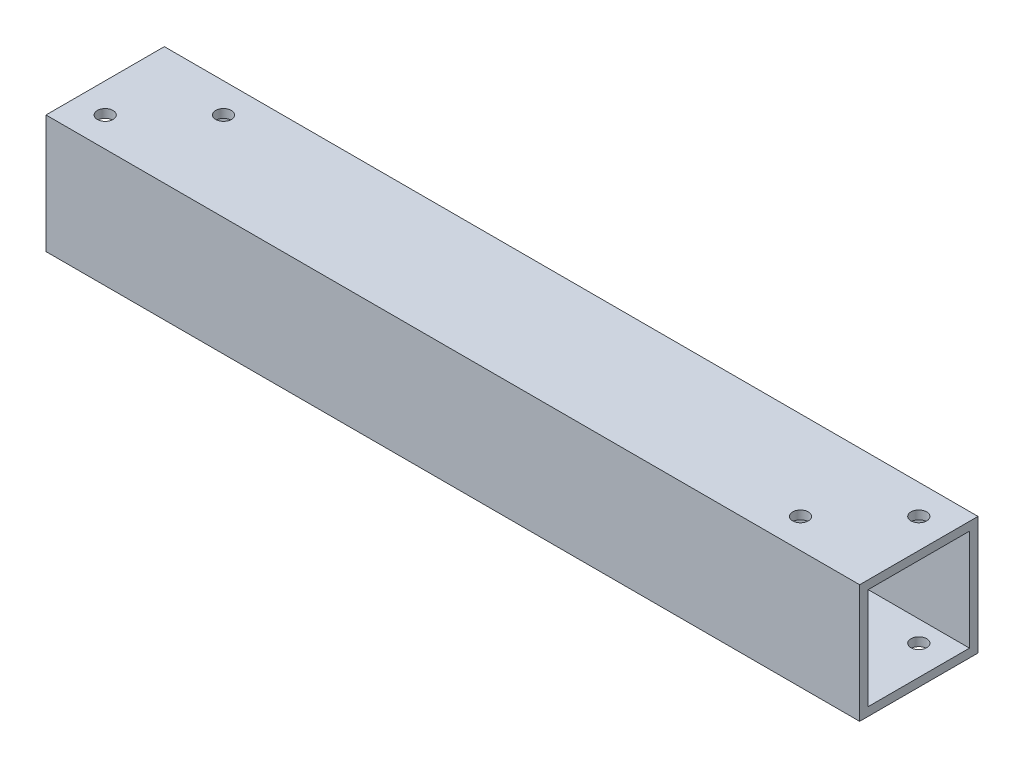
ISO-10303-21;
HEADER;
FILE_DESCRIPTION(('STEP AP214'),'2;1');
FILE_NAME('part.step','',(''),(''),'','','');
FILE_SCHEMA(('AUTOMOTIVE_DESIGN { 1 0 10303 214 1 1 1 1 }'));
ENDSEC;
DATA;
#1=APPLICATION_CONTEXT('core data for automotive mechanical design processes');
#2=APPLICATION_PROTOCOL_DEFINITION('international standard','automotive_design',2000,#1);
#3=PRODUCT_CONTEXT('',#1,'mechanical');
#4=PRODUCT('Part','Part','',(#3));
#5=PRODUCT_RELATED_PRODUCT_CATEGORY('part','',(#4));
#6=PRODUCT_DEFINITION_FORMATION('','',#4);
#7=PRODUCT_DEFINITION_CONTEXT('part definition',#1,'design');
#8=PRODUCT_DEFINITION('design','',#6,#7);
#9=PRODUCT_DEFINITION_SHAPE('','',#8);
#10=(LENGTH_UNIT() NAMED_UNIT(*) SI_UNIT(.MILLI.,.METRE.));
#11=(NAMED_UNIT(*) PLANE_ANGLE_UNIT() SI_UNIT($,.RADIAN.));
#12=(NAMED_UNIT(*) SI_UNIT($,.STERADIAN.) SOLID_ANGLE_UNIT());
#13=UNCERTAINTY_MEASURE_WITH_UNIT(LENGTH_MEASURE(1.E-05),#10,'distance_accuracy_value','');
#14=(GEOMETRIC_REPRESENTATION_CONTEXT(3) GLOBAL_UNCERTAINTY_ASSIGNED_CONTEXT((#13)) GLOBAL_UNIT_ASSIGNED_CONTEXT((#10,
#11,#12)) REPRESENTATION_CONTEXT('',''));
#15=CARTESIAN_POINT('',(0.,0.,0.));
#16=DIRECTION('',(0.,0.,1.));
#17=DIRECTION('',(1.,0.,0.));
#18=AXIS2_PLACEMENT_3D('',#15,#16,#17);
#19=CARTESIAN_POINT('',(349.25,50.7999999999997,0.));
#20=DIRECTION('',(-1.,0.,0.));
#21=DIRECTION('',(0.,0.,1.));
#22=AXIS2_PLACEMENT_3D('',#19,#20,#21);
#23=PLANE('',#22);
#24=DIRECTION('',(0.,-1.,0.));
#25=VECTOR('',#24,1.);
#26=CARTESIAN_POINT('',(349.25,1.11022302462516E-13,0.));
#27=LINE('',#26,#25);
#28=CARTESIAN_POINT('',(349.25,50.7999999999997,0.));
#29=VERTEX_POINT('',#28);
#30=CARTESIAN_POINT('',(349.25,1.11022302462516E-13,0.));
#31=VERTEX_POINT('',#30);
#32=EDGE_CURVE('E135',#29,#31,#27,.T.);
#33=ORIENTED_EDGE('',*,*,#32,.T.);
#34=DIRECTION('',(0.,0.,-1.));
#35=VECTOR('',#34,1.);
#36=CARTESIAN_POINT('',(349.25,1.11022302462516E-13,0.));
#37=LINE('',#36,#35);
#38=CARTESIAN_POINT('',(349.25,0.,-50.7999999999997));
#39=VERTEX_POINT('',#38);
#40=EDGE_CURVE('E138',#31,#39,#37,.T.);
#41=ORIENTED_EDGE('',*,*,#40,.T.);
#42=DIRECTION('',(0.,1.,0.));
#43=VECTOR('',#42,1.);
#44=CARTESIAN_POINT('',(349.25,0.,-50.7999999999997));
#45=LINE('',#44,#43);
#46=CARTESIAN_POINT('',(349.25,50.8,-50.7999999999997));
#47=VERTEX_POINT('',#46);
#48=EDGE_CURVE('E141',#39,#47,#45,.T.);
#49=ORIENTED_EDGE('',*,*,#48,.T.);
#50=DIRECTION('',(0.,0.,1.));
#51=VECTOR('',#50,1.);
#52=CARTESIAN_POINT('',(349.25,50.7999999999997,0.));
#53=LINE('',#52,#51);
#54=EDGE_CURVE('E143',#47,#29,#53,.T.);
#55=ORIENTED_EDGE('',*,*,#54,.T.);
#56=EDGE_LOOP('',(#33,#41,#49,#55));
#57=FACE_BOUND('',#56,.T.);
#58=DIRECTION('',(0.,-1.,0.));
#59=VECTOR('',#58,1.);
#60=CARTESIAN_POINT('',(349.25,47.1423999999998,-3.65760000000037));
#61=LINE('',#60,#59);
#62=CARTESIAN_POINT('',(349.25,47.1423999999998,-3.65760000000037));
#63=VERTEX_POINT('',#62);
#64=CARTESIAN_POINT('',(349.25,3.65760000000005,-3.65760000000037));
#65=VERTEX_POINT('',#64);
#66=EDGE_CURVE('E97',#63,#65,#61,.T.);
#67=ORIENTED_EDGE('',*,*,#66,.F.);
#68=DIRECTION('',(0.,0.,1.));
#69=VECTOR('',#68,1.);
#70=CARTESIAN_POINT('',(349.25,47.1423999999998,-3.65760000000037));
#71=LINE('',#70,#69);
#72=CARTESIAN_POINT('',(349.25,47.1424,-47.1424000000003));
#73=VERTEX_POINT('',#72);
#74=EDGE_CURVE('E119',#73,#63,#71,.T.);
#75=ORIENTED_EDGE('',*,*,#74,.F.);
#76=DIRECTION('',(0.,1.,0.));
#77=VECTOR('',#76,1.);
#78=CARTESIAN_POINT('',(349.25,47.1424,-47.1424000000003));
#79=LINE('',#78,#77);
#80=CARTESIAN_POINT('',(349.25,3.65760000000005,-47.1424000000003));
#81=VERTEX_POINT('',#80);
#82=EDGE_CURVE('E117',#81,#73,#79,.T.);
#83=ORIENTED_EDGE('',*,*,#82,.F.);
#84=DIRECTION('',(0.,0.,-1.));
#85=VECTOR('',#84,1.);
#86=CARTESIAN_POINT('',(349.25,3.65760000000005,-3.65760000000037));
#87=LINE('',#86,#85);
#88=EDGE_CURVE('E105',#65,#81,#87,.T.);
#89=ORIENTED_EDGE('',*,*,#88,.F.);
#90=EDGE_LOOP('',(#67,#75,#83,#89));
#91=FACE_BOUND('',#90,.T.);
#92=ADVANCED_FACE('F30',(#57,#91),#23,.F.);
#93=CARTESIAN_POINT('',(0.,50.7999999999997,0.));
#94=DIRECTION('',(-1.,0.,0.));
#95=DIRECTION('',(0.,0.,1.));
#96=AXIS2_PLACEMENT_3D('',#93,#94,#95);
#97=PLANE('',#96);
#98=DIRECTION('',(0.,-1.,0.));
#99=VECTOR('',#98,1.);
#100=CARTESIAN_POINT('',(0.,1.11022302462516E-13,0.));
#101=LINE('',#100,#99);
#102=CARTESIAN_POINT('',(0.,50.7999999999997,0.));
#103=VERTEX_POINT('',#102);
#104=CARTESIAN_POINT('',(0.,1.11022302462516E-13,0.));
#105=VERTEX_POINT('',#104);
#106=EDGE_CURVE('E113',#103,#105,#101,.T.);
#107=ORIENTED_EDGE('',*,*,#106,.F.);
#108=DIRECTION('',(0.,0.,1.));
#109=VECTOR('',#108,1.);
#110=CARTESIAN_POINT('',(0.,50.7999999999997,0.));
#111=LINE('',#110,#109);
#112=CARTESIAN_POINT('',(0.,50.8,-50.7999999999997));
#113=VERTEX_POINT('',#112);
#114=EDGE_CURVE('E139',#113,#103,#111,.T.);
#115=ORIENTED_EDGE('',*,*,#114,.F.);
#116=DIRECTION('',(0.,1.,0.));
#117=VECTOR('',#116,1.);
#118=CARTESIAN_POINT('',(0.,1.11022302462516E-13,-50.7999999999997));
#119=LINE('',#118,#117);
#120=CARTESIAN_POINT('',(0.,1.11022302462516E-13,-50.7999999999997));
#121=VERTEX_POINT('',#120);
#122=EDGE_CURVE('E150',#121,#113,#119,.T.);
#123=ORIENTED_EDGE('',*,*,#122,.F.);
#124=DIRECTION('',(0.,0.,-1.));
#125=VECTOR('',#124,1.);
#126=CARTESIAN_POINT('',(0.,1.11022302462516E-13,0.));
#127=LINE('',#126,#125);
#128=EDGE_CURVE('E148',#105,#121,#127,.T.);
#129=ORIENTED_EDGE('',*,*,#128,.F.);
#130=EDGE_LOOP('',(#107,#115,#123,#129));
#131=FACE_BOUND('',#130,.T.);
#132=DIRECTION('',(0.,0.,1.));
#133=VECTOR('',#132,1.);
#134=CARTESIAN_POINT('',(0.,47.1423999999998,-3.65760000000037));
#135=LINE('',#134,#133);
#136=CARTESIAN_POINT('',(0.,47.1424,-47.1424000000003));
#137=VERTEX_POINT('',#136);
#138=CARTESIAN_POINT('',(0.,47.1423999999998,-3.65760000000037));
#139=VERTEX_POINT('',#138);
#140=EDGE_CURVE('E106',#137,#139,#135,.T.);
#141=ORIENTED_EDGE('',*,*,#140,.T.);
#142=DIRECTION('',(0.,-1.,0.));
#143=VECTOR('',#142,1.);
#144=CARTESIAN_POINT('',(0.,47.1423999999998,-3.65760000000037));
#145=LINE('',#144,#143);
#146=CARTESIAN_POINT('',(0.,3.65760000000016,-3.65760000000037));
#147=VERTEX_POINT('',#146);
#148=EDGE_CURVE('E55',#139,#147,#145,.T.);
#149=ORIENTED_EDGE('',*,*,#148,.T.);
#150=DIRECTION('',(0.,0.,-1.));
#151=VECTOR('',#150,1.);
#152=CARTESIAN_POINT('',(0.,3.65760000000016,-3.65760000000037));
#153=LINE('',#152,#151);
#154=CARTESIAN_POINT('',(0.,3.65760000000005,-47.1424000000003));
#155=VERTEX_POINT('',#154);
#156=EDGE_CURVE('E112',#147,#155,#153,.T.);
#157=ORIENTED_EDGE('',*,*,#156,.T.);
#158=DIRECTION('',(0.,1.,0.));
#159=VECTOR('',#158,1.);
#160=CARTESIAN_POINT('',(0.,47.1424,-47.1424000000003));
#161=LINE('',#160,#159);
#162=EDGE_CURVE('E127',#155,#137,#161,.T.);
#163=ORIENTED_EDGE('',*,*,#162,.T.);
#164=EDGE_LOOP('',(#141,#149,#157,#163));
#165=FACE_BOUND('',#164,.T.);
#166=ADVANCED_FACE('F220',(#131,#165),#97,.T.);
#167=CARTESIAN_POINT('',(349.25,1.11022302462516E-13,0.));
#168=DIRECTION('',(0.,0.,-1.));
#169=DIRECTION('',(-1.,0.,0.));
#170=AXIS2_PLACEMENT_3D('',#167,#168,#169);
#171=PLANE('',#170);
#172=ORIENTED_EDGE('',*,*,#106,.T.);
#173=DIRECTION('',(-1.,0.,0.));
#174=VECTOR('',#173,1.);
#175=CARTESIAN_POINT('',(349.25,1.11022302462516E-13,0.));
#176=LINE('',#175,#174);
#177=EDGE_CURVE('E11',#31,#105,#176,.T.);
#178=ORIENTED_EDGE('',*,*,#177,.F.);
#179=ORIENTED_EDGE('',*,*,#32,.F.);
#180=DIRECTION('',(-1.,0.,0.));
#181=VECTOR('',#180,1.);
#182=CARTESIAN_POINT('',(349.25,50.7999999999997,0.));
#183=LINE('',#182,#181);
#184=EDGE_CURVE('E145',#29,#103,#183,.T.);
#185=ORIENTED_EDGE('',*,*,#184,.T.);
#186=EDGE_LOOP('',(#172,#178,#179,#185));
#187=FACE_BOUND('',#186,.T.);
#188=ADVANCED_FACE('F32',(#187),#171,.F.);
#189=CARTESIAN_POINT('',(349.25,1.11022302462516E-13,0.));
#190=DIRECTION('',(0.,1.,0.));
#191=DIRECTION('',(0.,0.,1.));
#192=AXIS2_PLACEMENT_3D('',#189,#190,#191);
#193=PLANE('',#192);
#194=CARTESIAN_POINT('',(311.15,0.,-12.6999999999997));
#195=DIRECTION('',(0.,1.,0.));
#196=DIRECTION('',(0.,0.,1.));
#197=AXIS2_PLACEMENT_3D('',#194,#195,#196);
#198=CIRCLE('',#197,3.37311999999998);
#199=CARTESIAN_POINT('',(311.15,0.,-9.32687999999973));
#200=VERTEX_POINT('',#199);
#201=EDGE_CURVE('E244',#200,#200,#198,.T.);
#202=ORIENTED_EDGE('',*,*,#201,.T.);
#203=EDGE_LOOP('',(#202));
#204=FACE_BOUND('',#203,.T.);
#205=CARTESIAN_POINT('',(336.55,0.,-38.1));
#206=DIRECTION('',(0.,1.,0.));
#207=DIRECTION('',(0.,0.,1.));
#208=AXIS2_PLACEMENT_3D('',#205,#206,#207);
#209=CIRCLE('',#208,3.37312000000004);
#210=CARTESIAN_POINT('',(336.55,0.,-34.72688));
#211=VERTEX_POINT('',#210);
#212=EDGE_CURVE('E171',#211,#211,#209,.T.);
#213=ORIENTED_EDGE('',*,*,#212,.T.);
#214=EDGE_LOOP('',(#213));
#215=FACE_BOUND('',#214,.T.);
#216=CARTESIAN_POINT('',(38.1000000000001,1.11022302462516E-13,-38.1));
#217=DIRECTION('',(0.,1.,0.));
#218=DIRECTION('',(0.,0.,1.));
#219=AXIS2_PLACEMENT_3D('',#216,#217,#218);
#220=CIRCLE('',#219,3.37312);
#221=CARTESIAN_POINT('',(38.1000000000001,1.11076716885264E-13,-34.72688));
#222=VERTEX_POINT('',#221);
#223=EDGE_CURVE('E167',#222,#222,#220,.T.);
#224=ORIENTED_EDGE('',*,*,#223,.T.);
#225=EDGE_LOOP('',(#224));
#226=FACE_BOUND('',#225,.T.);
#227=CARTESIAN_POINT('',(12.7,1.11022302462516E-13,-12.6999999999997));
#228=DIRECTION('',(0.,1.,0.));
#229=DIRECTION('',(0.,0.,1.));
#230=AXIS2_PLACEMENT_3D('',#227,#228,#229);
#231=CIRCLE('',#230,3.37312);
#232=CARTESIAN_POINT('',(12.7,1.11076716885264E-13,-9.32687999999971));
#233=VERTEX_POINT('',#232);
#234=EDGE_CURVE('E163',#233,#233,#231,.T.);
#235=ORIENTED_EDGE('',*,*,#234,.T.);
#236=EDGE_LOOP('',(#235));
#237=FACE_BOUND('',#236,.T.);
#238=ORIENTED_EDGE('',*,*,#128,.T.);
#239=DIRECTION('',(-1.,0.,0.));
#240=VECTOR('',#239,1.);
#241=CARTESIAN_POINT('',(349.25,0.,-50.7999999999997));
#242=LINE('',#241,#240);
#243=EDGE_CURVE('E39',#39,#121,#242,.T.);
#244=ORIENTED_EDGE('',*,*,#243,.F.);
#245=ORIENTED_EDGE('',*,*,#40,.F.);
#246=ORIENTED_EDGE('',*,*,#177,.T.);
#247=EDGE_LOOP('',(#238,#244,#245,#246));
#248=FACE_BOUND('',#247,.T.);
#249=ADVANCED_FACE('F234',(#204,#215,#226,#237,#248),#193,.F.);
#250=CARTESIAN_POINT('',(349.25,0.,-50.7999999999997));
#251=DIRECTION('',(0.,0.,1.));
#252=DIRECTION('',(1.,0.,0.));
#253=AXIS2_PLACEMENT_3D('',#250,#251,#252);
#254=PLANE('',#253);
#255=ORIENTED_EDGE('',*,*,#122,.T.);
#256=DIRECTION('',(-1.,0.,0.));
#257=VECTOR('',#256,1.);
#258=CARTESIAN_POINT('',(349.25,50.8,-50.7999999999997));
#259=LINE('',#258,#257);
#260=EDGE_CURVE('E155',#47,#113,#259,.T.);
#261=ORIENTED_EDGE('',*,*,#260,.F.);
#262=ORIENTED_EDGE('',*,*,#48,.F.);
#263=ORIENTED_EDGE('',*,*,#243,.T.);
#264=EDGE_LOOP('',(#255,#261,#262,#263));
#265=FACE_BOUND('',#264,.T.);
#266=ADVANCED_FACE('F231',(#265),#254,.F.);
#267=CARTESIAN_POINT('',(349.25,50.7999999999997,0.));
#268=DIRECTION('',(0.,-1.,0.));
#269=DIRECTION('',(0.,0.,-1.));
#270=AXIS2_PLACEMENT_3D('',#267,#268,#269);
#271=PLANE('',#270);
#272=CARTESIAN_POINT('',(311.15,50.7999999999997,-12.6999999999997));
#273=DIRECTION('',(0.,1.,0.));
#274=DIRECTION('',(0.,0.,1.));
#275=AXIS2_PLACEMENT_3D('',#272,#273,#274);
#276=CIRCLE('',#275,3.37311999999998);
#277=CARTESIAN_POINT('',(311.15,50.7999999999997,-9.32687999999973));
#278=VERTEX_POINT('',#277);
#279=EDGE_CURVE('E298',#278,#278,#276,.T.);
#280=ORIENTED_EDGE('',*,*,#279,.F.);
#281=EDGE_LOOP('',(#280));
#282=FACE_BOUND('',#281,.T.);
#283=CARTESIAN_POINT('',(336.55,50.8,-38.1));
#284=DIRECTION('',(0.,1.,0.));
#285=DIRECTION('',(0.,0.,1.));
#286=AXIS2_PLACEMENT_3D('',#283,#284,#285);
#287=CIRCLE('',#286,3.37312000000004);
#288=CARTESIAN_POINT('',(336.55,50.8,-34.72688));
#289=VERTEX_POINT('',#288);
#290=EDGE_CURVE('E178',#289,#289,#287,.T.);
#291=ORIENTED_EDGE('',*,*,#290,.F.);
#292=EDGE_LOOP('',(#291));
#293=FACE_BOUND('',#292,.T.);
#294=CARTESIAN_POINT('',(38.1,50.8,-38.1));
#295=DIRECTION('',(0.,1.,0.));
#296=DIRECTION('',(0.,0.,1.));
#297=AXIS2_PLACEMENT_3D('',#294,#295,#296);
#298=CIRCLE('',#297,3.37312);
#299=CARTESIAN_POINT('',(38.1,50.8,-34.72688));
#300=VERTEX_POINT('',#299);
#301=EDGE_CURVE('E175',#300,#300,#298,.T.);
#302=ORIENTED_EDGE('',*,*,#301,.F.);
#303=EDGE_LOOP('',(#302));
#304=FACE_BOUND('',#303,.T.);
#305=CARTESIAN_POINT('',(12.7,50.7999999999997,-12.6999999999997));
#306=DIRECTION('',(0.,1.,0.));
#307=DIRECTION('',(0.,0.,1.));
#308=AXIS2_PLACEMENT_3D('',#305,#306,#307);
#309=CIRCLE('',#308,3.37312);
#310=CARTESIAN_POINT('',(12.7,50.7999999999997,-9.32687999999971));
#311=VERTEX_POINT('',#310);
#312=EDGE_CURVE('E194',#311,#311,#309,.T.);
#313=ORIENTED_EDGE('',*,*,#312,.F.);
#314=EDGE_LOOP('',(#313));
#315=FACE_BOUND('',#314,.T.);
#316=ORIENTED_EDGE('',*,*,#114,.T.);
#317=ORIENTED_EDGE('',*,*,#184,.F.);
#318=ORIENTED_EDGE('',*,*,#54,.F.);
#319=ORIENTED_EDGE('',*,*,#260,.T.);
#320=EDGE_LOOP('',(#316,#317,#318,#319));
#321=FACE_BOUND('',#320,.T.);
#322=ADVANCED_FACE('F215',(#282,#293,#304,#315,#321),#271,.F.);
#323=CARTESIAN_POINT('',(349.25,47.1423999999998,-3.65760000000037));
#324=DIRECTION('',(0.,0.,-1.));
#325=DIRECTION('',(0.,1.,0.));
#326=AXIS2_PLACEMENT_3D('',#323,#324,#325);
#327=PLANE('',#326);
#328=ORIENTED_EDGE('',*,*,#148,.F.);
#329=DIRECTION('',(-1.,0.,0.));
#330=VECTOR('',#329,1.);
#331=CARTESIAN_POINT('',(349.25,47.1423999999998,-3.65760000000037));
#332=LINE('',#331,#330);
#333=EDGE_CURVE('E101',#63,#139,#332,.T.);
#334=ORIENTED_EDGE('',*,*,#333,.F.);
#335=ORIENTED_EDGE('',*,*,#66,.T.);
#336=DIRECTION('',(-1.,0.,0.));
#337=VECTOR('',#336,1.);
#338=CARTESIAN_POINT('',(349.25,3.65760000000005,-3.65760000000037));
#339=LINE('',#338,#337);
#340=EDGE_CURVE('E100',#65,#147,#339,.T.);
#341=ORIENTED_EDGE('',*,*,#340,.T.);
#342=EDGE_LOOP('',(#328,#334,#335,#341));
#343=FACE_BOUND('',#342,.T.);
#344=ADVANCED_FACE('F99',(#343),#327,.T.);
#345=CARTESIAN_POINT('',(349.25,3.65760000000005,-3.65760000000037));
#346=DIRECTION('',(0.,1.,0.));
#347=DIRECTION('',(0.,0.,1.));
#348=AXIS2_PLACEMENT_3D('',#345,#346,#347);
#349=PLANE('',#348);
#350=CARTESIAN_POINT('',(311.15,3.65760000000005,-12.6999999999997));
#351=DIRECTION('',(0.,1.,0.));
#352=DIRECTION('',(0.,0.,1.));
#353=AXIS2_PLACEMENT_3D('',#350,#351,#352);
#354=CIRCLE('',#353,3.37311999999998);
#355=CARTESIAN_POINT('',(311.15,3.65760000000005,-9.32687999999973));
#356=VERTEX_POINT('',#355);
#357=EDGE_CURVE('E183',#356,#356,#354,.T.);
#358=ORIENTED_EDGE('',*,*,#357,.F.);
#359=EDGE_LOOP('',(#358));
#360=FACE_BOUND('',#359,.T.);
#361=CARTESIAN_POINT('',(336.55,3.65760000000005,-38.1));
#362=DIRECTION('',(0.,1.,0.));
#363=DIRECTION('',(0.,0.,1.));
#364=AXIS2_PLACEMENT_3D('',#361,#362,#363);
#365=CIRCLE('',#364,3.37312000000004);
#366=CARTESIAN_POINT('',(336.55,3.65760000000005,-34.72688));
#367=VERTEX_POINT('',#366);
#368=EDGE_CURVE('E170',#367,#367,#365,.T.);
#369=ORIENTED_EDGE('',*,*,#368,.F.);
#370=EDGE_LOOP('',(#369));
#371=FACE_BOUND('',#370,.T.);
#372=CARTESIAN_POINT('',(38.1000000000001,3.65760000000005,-38.1));
#373=DIRECTION('',(0.,1.,0.));
#374=DIRECTION('',(0.,0.,1.));
#375=AXIS2_PLACEMENT_3D('',#372,#373,#374);
#376=CIRCLE('',#375,3.37312);
#377=CARTESIAN_POINT('',(38.1000000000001,3.65760000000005,-34.72688));
#378=VERTEX_POINT('',#377);
#379=EDGE_CURVE('E166',#378,#378,#376,.T.);
#380=ORIENTED_EDGE('',*,*,#379,.F.);
#381=EDGE_LOOP('',(#380));
#382=FACE_BOUND('',#381,.T.);
#383=CARTESIAN_POINT('',(12.7,3.65760000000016,-12.6999999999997));
#384=DIRECTION('',(0.,1.,0.));
#385=DIRECTION('',(0.,0.,1.));
#386=AXIS2_PLACEMENT_3D('',#383,#384,#385);
#387=CIRCLE('',#386,3.37312);
#388=CARTESIAN_POINT('',(12.7,3.65760000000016,-9.32687999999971));
#389=VERTEX_POINT('',#388);
#390=EDGE_CURVE('E125',#389,#389,#387,.T.);
#391=ORIENTED_EDGE('',*,*,#390,.F.);
#392=EDGE_LOOP('',(#391));
#393=FACE_BOUND('',#392,.T.);
#394=ORIENTED_EDGE('',*,*,#156,.F.);
#395=ORIENTED_EDGE('',*,*,#340,.F.);
#396=ORIENTED_EDGE('',*,*,#88,.T.);
#397=DIRECTION('',(-1.,0.,0.));
#398=VECTOR('',#397,1.);
#399=CARTESIAN_POINT('',(349.25,3.65760000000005,-47.1424000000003));
#400=LINE('',#399,#398);
#401=EDGE_CURVE('E114',#81,#155,#400,.T.);
#402=ORIENTED_EDGE('',*,*,#401,.T.);
#403=EDGE_LOOP('',(#394,#395,#396,#402));
#404=FACE_BOUND('',#403,.T.);
#405=ADVANCED_FACE('F109',(#360,#371,#382,#393,#404),#349,.T.);
#406=CARTESIAN_POINT('',(349.25,47.1424,-47.1424000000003));
#407=DIRECTION('',(0.,0.,1.));
#408=DIRECTION('',(0.,-1.,0.));
#409=AXIS2_PLACEMENT_3D('',#406,#407,#408);
#410=PLANE('',#409);
#411=ORIENTED_EDGE('',*,*,#162,.F.);
#412=ORIENTED_EDGE('',*,*,#401,.F.);
#413=ORIENTED_EDGE('',*,*,#82,.T.);
#414=DIRECTION('',(-1.,0.,0.));
#415=VECTOR('',#414,1.);
#416=CARTESIAN_POINT('',(349.25,47.1424,-47.1424000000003));
#417=LINE('',#416,#415);
#418=EDGE_CURVE('E47',#73,#137,#417,.T.);
#419=ORIENTED_EDGE('',*,*,#418,.T.);
#420=EDGE_LOOP('',(#411,#412,#413,#419));
#421=FACE_BOUND('',#420,.T.);
#422=ADVANCED_FACE('F205',(#421),#410,.T.);
#423=CARTESIAN_POINT('',(349.25,47.1423999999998,-3.65760000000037));
#424=DIRECTION('',(0.,-1.,0.));
#425=DIRECTION('',(0.,0.,-1.));
#426=AXIS2_PLACEMENT_3D('',#423,#424,#425);
#427=PLANE('',#426);
#428=CARTESIAN_POINT('',(311.15,47.1423999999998,-12.6999999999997));
#429=DIRECTION('',(0.,-1.,0.));
#430=DIRECTION('',(0.,0.,-1.));
#431=AXIS2_PLACEMENT_3D('',#428,#429,#430);
#432=CIRCLE('',#431,3.37311999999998);
#433=CARTESIAN_POINT('',(311.15,47.1423999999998,-16.0731199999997));
#434=VERTEX_POINT('',#433);
#435=EDGE_CURVE('E34',#434,#434,#432,.T.);
#436=ORIENTED_EDGE('',*,*,#435,.F.);
#437=EDGE_LOOP('',(#436));
#438=FACE_BOUND('',#437,.T.);
#439=CARTESIAN_POINT('',(336.55,47.1424,-38.1));
#440=DIRECTION('',(0.,-1.,0.));
#441=DIRECTION('',(0.,0.,-1.));
#442=AXIS2_PLACEMENT_3D('',#439,#440,#441);
#443=CIRCLE('',#442,3.37312000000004);
#444=CARTESIAN_POINT('',(336.55,47.1424,-41.4731200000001));
#445=VERTEX_POINT('',#444);
#446=EDGE_CURVE('E168',#445,#445,#443,.T.);
#447=ORIENTED_EDGE('',*,*,#446,.F.);
#448=EDGE_LOOP('',(#447));
#449=FACE_BOUND('',#448,.T.);
#450=CARTESIAN_POINT('',(38.1,47.1424,-38.1));
#451=DIRECTION('',(0.,-1.,0.));
#452=DIRECTION('',(0.,0.,-1.));
#453=AXIS2_PLACEMENT_3D('',#450,#451,#452);
#454=CIRCLE('',#453,3.37312);
#455=CARTESIAN_POINT('',(38.1,47.1424,-41.47312));
#456=VERTEX_POINT('',#455);
#457=EDGE_CURVE('E164',#456,#456,#454,.T.);
#458=ORIENTED_EDGE('',*,*,#457,.F.);
#459=EDGE_LOOP('',(#458));
#460=FACE_BOUND('',#459,.T.);
#461=CARTESIAN_POINT('',(12.7,47.1423999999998,-12.6999999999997));
#462=DIRECTION('',(0.,-1.,0.));
#463=DIRECTION('',(0.,0.,-1.));
#464=AXIS2_PLACEMENT_3D('',#461,#462,#463);
#465=CIRCLE('',#464,3.37312);
#466=CARTESIAN_POINT('',(12.7,47.1423999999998,-16.0731199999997));
#467=VERTEX_POINT('',#466);
#468=EDGE_CURVE('E160',#467,#467,#465,.T.);
#469=ORIENTED_EDGE('',*,*,#468,.F.);
#470=EDGE_LOOP('',(#469));
#471=FACE_BOUND('',#470,.T.);
#472=ORIENTED_EDGE('',*,*,#140,.F.);
#473=ORIENTED_EDGE('',*,*,#418,.F.);
#474=ORIENTED_EDGE('',*,*,#74,.T.);
#475=ORIENTED_EDGE('',*,*,#333,.T.);
#476=EDGE_LOOP('',(#472,#473,#474,#475));
#477=FACE_BOUND('',#476,.T.);
#478=ADVANCED_FACE('F212',(#438,#449,#460,#471,#477),#427,.T.);
#479=CARTESIAN_POINT('',(12.7,1.11022302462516E-13,-12.6999999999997));
#480=DIRECTION('',(0.,1.,0.));
#481=DIRECTION('',(0.,0.,1.));
#482=AXIS2_PLACEMENT_3D('',#479,#480,#481);
#483=CYLINDRICAL_SURFACE('',#482,3.37312);
#484=ORIENTED_EDGE('',*,*,#468,.T.);
#485=EDGE_LOOP('',(#484));
#486=FACE_BOUND('',#485,.T.);
#487=ORIENTED_EDGE('',*,*,#312,.T.);
#488=EDGE_LOOP('',(#487));
#489=FACE_BOUND('',#488,.T.);
#490=ADVANCED_FACE('F264',(#486,#489),#483,.F.);
#491=ORIENTED_EDGE('',*,*,#390,.T.);
#492=EDGE_LOOP('',(#491));
#493=FACE_BOUND('',#492,.T.);
#494=ORIENTED_EDGE('',*,*,#234,.F.);
#495=EDGE_LOOP('',(#494));
#496=FACE_BOUND('',#495,.T.);
#497=ADVANCED_FACE('F201',(#493,#496),#483,.F.);
#498=CARTESIAN_POINT('',(38.1000000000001,1.11022302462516E-13,-38.1));
#499=DIRECTION('',(0.,1.,0.));
#500=DIRECTION('',(0.,0.,1.));
#501=AXIS2_PLACEMENT_3D('',#498,#499,#500);
#502=CYLINDRICAL_SURFACE('',#501,3.37312);
#503=ORIENTED_EDGE('',*,*,#457,.T.);
#504=EDGE_LOOP('',(#503));
#505=FACE_BOUND('',#504,.T.);
#506=ORIENTED_EDGE('',*,*,#301,.T.);
#507=EDGE_LOOP('',(#506));
#508=FACE_BOUND('',#507,.T.);
#509=ADVANCED_FACE('F275',(#505,#508),#502,.F.);
#510=ORIENTED_EDGE('',*,*,#379,.T.);
#511=EDGE_LOOP('',(#510));
#512=FACE_BOUND('',#511,.T.);
#513=ORIENTED_EDGE('',*,*,#223,.F.);
#514=EDGE_LOOP('',(#513));
#515=FACE_BOUND('',#514,.T.);
#516=ADVANCED_FACE('F278',(#512,#515),#502,.F.);
#517=CARTESIAN_POINT('',(336.55,0.,-38.1));
#518=DIRECTION('',(0.,1.,0.));
#519=DIRECTION('',(0.,0.,1.));
#520=AXIS2_PLACEMENT_3D('',#517,#518,#519);
#521=CYLINDRICAL_SURFACE('',#520,3.37312000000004);
#522=ORIENTED_EDGE('',*,*,#446,.T.);
#523=EDGE_LOOP('',(#522));
#524=FACE_BOUND('',#523,.T.);
#525=ORIENTED_EDGE('',*,*,#290,.T.);
#526=EDGE_LOOP('',(#525));
#527=FACE_BOUND('',#526,.T.);
#528=ADVANCED_FACE('F280',(#524,#527),#521,.F.);
#529=ORIENTED_EDGE('',*,*,#368,.T.);
#530=EDGE_LOOP('',(#529));
#531=FACE_BOUND('',#530,.T.);
#532=ORIENTED_EDGE('',*,*,#212,.F.);
#533=EDGE_LOOP('',(#532));
#534=FACE_BOUND('',#533,.T.);
#535=ADVANCED_FACE('F283',(#531,#534),#521,.F.);
#536=CARTESIAN_POINT('',(311.15,0.,-12.6999999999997));
#537=DIRECTION('',(0.,1.,0.));
#538=DIRECTION('',(0.,0.,1.));
#539=AXIS2_PLACEMENT_3D('',#536,#537,#538);
#540=CYLINDRICAL_SURFACE('',#539,3.37311999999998);
#541=ORIENTED_EDGE('',*,*,#435,.T.);
#542=EDGE_LOOP('',(#541));
#543=FACE_BOUND('',#542,.T.);
#544=ORIENTED_EDGE('',*,*,#279,.T.);
#545=EDGE_LOOP('',(#544));
#546=FACE_BOUND('',#545,.T.);
#547=ADVANCED_FACE('F284',(#543,#546),#540,.F.);
#548=ORIENTED_EDGE('',*,*,#357,.T.);
#549=EDGE_LOOP('',(#548));
#550=FACE_BOUND('',#549,.T.);
#551=ORIENTED_EDGE('',*,*,#201,.F.);
#552=EDGE_LOOP('',(#551));
#553=FACE_BOUND('',#552,.T.);
#554=ADVANCED_FACE('F286',(#550,#553),#540,.F.);
#555=CLOSED_SHELL('',(#92,#166,#188,#249,#266,#322,#344,#405,#422,#478,#490,#497,#509,#516,#528,
#535,#547,#554));
#556=MANIFOLD_SOLID_BREP('B2',#555);
#557=ADVANCED_BREP_SHAPE_REPRESENTATION('',(#18,#556),#14);
#558=SHAPE_DEFINITION_REPRESENTATION(#9,#557);
ENDSEC;
END-ISO-10303-21;
